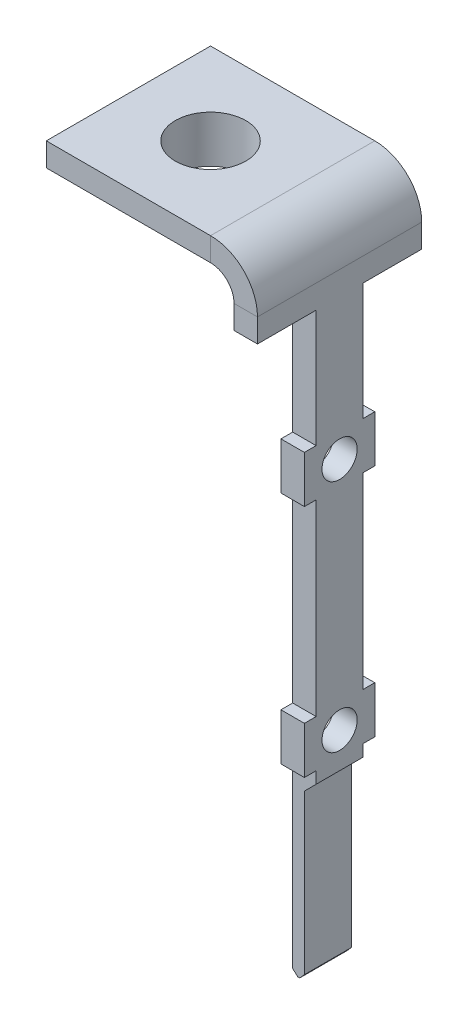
ISO-10303-21;
HEADER;
FILE_DESCRIPTION(('STEP AP214'),'2;1');
FILE_NAME('part.step','',(''),(''),'','','');
FILE_SCHEMA(('AUTOMOTIVE_DESIGN { 1 0 10303 214 1 1 1 1 }'));
ENDSEC;
DATA;
#1=APPLICATION_CONTEXT('core data for automotive mechanical design processes');
#2=APPLICATION_PROTOCOL_DEFINITION('international standard','automotive_design',2000,#1);
#3=PRODUCT_CONTEXT('',#1,'mechanical');
#4=PRODUCT('Part','Part','',(#3));
#5=PRODUCT_RELATED_PRODUCT_CATEGORY('part','',(#4));
#6=PRODUCT_DEFINITION_FORMATION('','',#4);
#7=PRODUCT_DEFINITION_CONTEXT('part definition',#1,'design');
#8=PRODUCT_DEFINITION('design','',#6,#7);
#9=PRODUCT_DEFINITION_SHAPE('','',#8);
#10=(LENGTH_UNIT() NAMED_UNIT(*) SI_UNIT(.MILLI.,.METRE.));
#11=(NAMED_UNIT(*) PLANE_ANGLE_UNIT() SI_UNIT($,.RADIAN.));
#12=(NAMED_UNIT(*) SI_UNIT($,.STERADIAN.) SOLID_ANGLE_UNIT());
#13=UNCERTAINTY_MEASURE_WITH_UNIT(LENGTH_MEASURE(1.E-05),#10,'distance_accuracy_value','');
#14=(GEOMETRIC_REPRESENTATION_CONTEXT(3) GLOBAL_UNCERTAINTY_ASSIGNED_CONTEXT((#13)) GLOBAL_UNIT_ASSIGNED_CONTEXT((#10,
#11,#12)) REPRESENTATION_CONTEXT('',''));
#15=CARTESIAN_POINT('',(0.,0.,0.));
#16=DIRECTION('',(0.,0.,1.));
#17=DIRECTION('',(1.,0.,0.));
#18=AXIS2_PLACEMENT_3D('',#15,#16,#17);
#19=CARTESIAN_POINT('',(-3.5,-1.,-3.5));
#20=DIRECTION('',(0.,-1.,0.));
#21=DIRECTION('',(0.,0.,-1.));
#22=AXIS2_PLACEMENT_3D('',#19,#20,#21);
#23=PLANE('',#22);
#24=CARTESIAN_POINT('',(0.,-1.,0.));
#25=DIRECTION('',(0.,-1.,0.));
#26=DIRECTION('',(0.,0.,-1.));
#27=AXIS2_PLACEMENT_3D('',#24,#25,#26);
#28=CIRCLE('',#27,2.5);
#29=CARTESIAN_POINT('',(0.,-1.,-2.5));
#30=VERTEX_POINT('',#29);
#31=EDGE_CURVE('E13',#30,#30,#28,.F.);
#32=ORIENTED_EDGE('',*,*,#31,.T.);
#33=EDGE_LOOP('',(#32));
#34=FACE_BOUND('',#33,.T.);
#35=DIRECTION('',(0.,0.,1.));
#36=VECTOR('',#35,1.);
#37=CARTESIAN_POINT('',(-3.5,-1.,3.5));
#38=LINE('',#37,#36);
#39=CARTESIAN_POINT('',(-3.5,-1.,-3.5));
#40=VERTEX_POINT('',#39);
#41=CARTESIAN_POINT('',(-3.5,-1.,3.5));
#42=VERTEX_POINT('',#41);
#43=EDGE_CURVE('E509',#40,#42,#38,.T.);
#44=ORIENTED_EDGE('',*,*,#43,.F.);
#45=DIRECTION('',(-1.,0.,0.));
#46=VECTOR('',#45,1.);
#47=CARTESIAN_POINT('',(-3.5,-1.,-3.5));
#48=LINE('',#47,#46);
#49=CARTESIAN_POINT('',(3.5,-1.,-3.5));
#50=VERTEX_POINT('',#49);
#51=EDGE_CURVE('E517',#50,#40,#48,.T.);
#52=ORIENTED_EDGE('',*,*,#51,.F.);
#53=DIRECTION('',(0.,0.,-1.));
#54=VECTOR('',#53,1.);
#55=CARTESIAN_POINT('',(3.5,-1.,3.5));
#56=LINE('',#55,#54);
#57=CARTESIAN_POINT('',(3.5,-1.,3.5));
#58=VERTEX_POINT('',#57);
#59=EDGE_CURVE('E515',#58,#50,#56,.T.);
#60=ORIENTED_EDGE('',*,*,#59,.F.);
#61=DIRECTION('',(1.,0.,0.));
#62=VECTOR('',#61,1.);
#63=CARTESIAN_POINT('',(-3.5,-1.,3.5));
#64=LINE('',#63,#62);
#65=EDGE_CURVE('E512',#42,#58,#64,.T.);
#66=ORIENTED_EDGE('',*,*,#65,.F.);
#67=EDGE_LOOP('',(#44,#52,#60,#66));
#68=FACE_BOUND('',#67,.T.);
#69=ADVANCED_FACE('F48',(#34,#68),#23,.T.);
#70=CARTESIAN_POINT('',(-3.5,-1.,3.5));
#71=DIRECTION('',(-1.,0.,0.));
#72=DIRECTION('',(0.,0.,1.));
#73=AXIS2_PLACEMENT_3D('',#70,#71,#72);
#74=PLANE('',#73);
#75=DIRECTION('',(0.,0.,1.));
#76=VECTOR('',#75,1.);
#77=CARTESIAN_POINT('',(-3.5,0.,3.5));
#78=LINE('',#77,#76);
#79=CARTESIAN_POINT('',(-3.5,0.,-3.5));
#80=VERTEX_POINT('',#79);
#81=CARTESIAN_POINT('',(-3.5,0.,3.5));
#82=VERTEX_POINT('',#81);
#83=EDGE_CURVE('E495',#80,#82,#78,.T.);
#84=ORIENTED_EDGE('',*,*,#83,.F.);
#85=DIRECTION('',(0.,1.,0.));
#86=VECTOR('',#85,1.);
#87=CARTESIAN_POINT('',(-3.5,-1.,-3.5));
#88=LINE('',#87,#86);
#89=EDGE_CURVE('E521',#40,#80,#88,.T.);
#90=ORIENTED_EDGE('',*,*,#89,.F.);
#91=ORIENTED_EDGE('',*,*,#43,.T.);
#92=DIRECTION('',(0.,1.,0.));
#93=VECTOR('',#92,1.);
#94=CARTESIAN_POINT('',(-3.5,-1.,3.5));
#95=LINE('',#94,#93);
#96=EDGE_CURVE('E520',#42,#82,#95,.T.);
#97=ORIENTED_EDGE('',*,*,#96,.T.);
#98=EDGE_LOOP('',(#84,#90,#91,#97));
#99=FACE_BOUND('',#98,.T.);
#100=ADVANCED_FACE('F50',(#99),#74,.T.);
#101=CARTESIAN_POINT('',(-3.5,-1.,-3.5));
#102=DIRECTION('',(0.,0.,-1.));
#103=DIRECTION('',(-1.,0.,0.));
#104=AXIS2_PLACEMENT_3D('',#101,#102,#103);
#105=PLANE('',#104);
#106=DIRECTION('',(-1.,0.,0.));
#107=VECTOR('',#106,1.);
#108=CARTESIAN_POINT('',(-3.5,0.,-3.5));
#109=LINE('',#108,#107);
#110=CARTESIAN_POINT('',(3.5,0.,-3.5));
#111=VERTEX_POINT('',#110);
#112=EDGE_CURVE('E506',#111,#80,#109,.T.);
#113=ORIENTED_EDGE('',*,*,#112,.F.);
#114=DIRECTION('',(0.,1.,0.));
#115=VECTOR('',#114,1.);
#116=CARTESIAN_POINT('',(3.5,-1.,-3.5));
#117=LINE('',#116,#115);
#118=EDGE_CURVE('E523',#50,#111,#117,.T.);
#119=ORIENTED_EDGE('',*,*,#118,.F.);
#120=ORIENTED_EDGE('',*,*,#51,.T.);
#121=ORIENTED_EDGE('',*,*,#89,.T.);
#122=EDGE_LOOP('',(#113,#119,#120,#121));
#123=FACE_BOUND('',#122,.T.);
#124=ADVANCED_FACE('F567',(#123),#105,.T.);
#125=CARTESIAN_POINT('',(-3.5,-1.,3.5));
#126=DIRECTION('',(0.,0.,1.));
#127=DIRECTION('',(1.,0.,0.));
#128=AXIS2_PLACEMENT_3D('',#125,#126,#127);
#129=PLANE('',#128);
#130=DIRECTION('',(1.,0.,0.));
#131=VECTOR('',#130,1.);
#132=CARTESIAN_POINT('',(-3.5,0.,3.5));
#133=LINE('',#132,#131);
#134=CARTESIAN_POINT('',(3.5,0.,3.5));
#135=VERTEX_POINT('',#134);
#136=EDGE_CURVE('E500',#82,#135,#133,.T.);
#137=ORIENTED_EDGE('',*,*,#136,.F.);
#138=ORIENTED_EDGE('',*,*,#96,.F.);
#139=ORIENTED_EDGE('',*,*,#65,.T.);
#140=DIRECTION('',(0.,1.,0.));
#141=VECTOR('',#140,1.);
#142=CARTESIAN_POINT('',(3.5,-1.,3.5));
#143=LINE('',#142,#141);
#144=EDGE_CURVE('E526',#58,#135,#143,.T.);
#145=ORIENTED_EDGE('',*,*,#144,.T.);
#146=EDGE_LOOP('',(#137,#138,#139,#145));
#147=FACE_BOUND('',#146,.T.);
#148=ADVANCED_FACE('F575',(#147),#129,.T.);
#149=CARTESIAN_POINT('',(-3.5,0.,-3.5));
#150=DIRECTION('',(0.,-1.,0.));
#151=DIRECTION('',(0.,0.,-1.));
#152=AXIS2_PLACEMENT_3D('',#149,#150,#151);
#153=PLANE('',#152);
#154=CARTESIAN_POINT('',(0.,0.,0.));
#155=DIRECTION('',(0.,1.,0.));
#156=DIRECTION('',(0.,0.,1.));
#157=AXIS2_PLACEMENT_3D('',#154,#155,#156);
#158=CIRCLE('',#157,1.5);
#159=CARTESIAN_POINT('',(0.,0.,1.5));
#160=VERTEX_POINT('',#159);
#161=EDGE_CURVE('E272',#160,#160,#158,.T.);
#162=ORIENTED_EDGE('',*,*,#161,.F.);
#163=EDGE_LOOP('',(#162));
#164=FACE_BOUND('',#163,.T.);
#165=ORIENTED_EDGE('',*,*,#83,.T.);
#166=ORIENTED_EDGE('',*,*,#136,.T.);
#167=DIRECTION('',(0.,0.,-1.));
#168=VECTOR('',#167,1.);
#169=CARTESIAN_POINT('',(3.5,0.,3.5));
#170=LINE('',#169,#168);
#171=EDGE_CURVE('E503',#135,#111,#170,.T.);
#172=ORIENTED_EDGE('',*,*,#171,.T.);
#173=ORIENTED_EDGE('',*,*,#112,.T.);
#174=EDGE_LOOP('',(#165,#166,#172,#173));
#175=FACE_BOUND('',#174,.T.);
#176=ADVANCED_FACE('F572',(#164,#175),#153,.F.);
#177=CARTESIAN_POINT('',(3.5,-2.,-3.5));
#178=DIRECTION('',(0.,0.,-1.));
#179=DIRECTION('',(-1.,0.,0.));
#180=AXIS2_PLACEMENT_3D('',#177,#178,#179);
#181=PLANE('',#180);
#182=DIRECTION('',(-1.,0.,0.));
#183=VECTOR('',#182,1.);
#184=CARTESIAN_POINT('',(5.5,-1.99999999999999,-3.5));
#185=LINE('',#184,#183);
#186=CARTESIAN_POINT('',(4.5,-2.,-3.5));
#187=VERTEX_POINT('',#186);
#188=CARTESIAN_POINT('',(5.5,-1.99999999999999,-3.5));
#189=VERTEX_POINT('',#188);
#190=EDGE_CURVE('E444',#187,#189,#185,.F.);
#191=ORIENTED_EDGE('',*,*,#190,.F.);
#192=CARTESIAN_POINT('',(3.5,-2.,-3.5));
#193=DIRECTION('',(0.,0.,1.));
#194=DIRECTION('',(1.,0.,0.));
#195=AXIS2_PLACEMENT_3D('',#192,#193,#194);
#196=CIRCLE('',#195,1.);
#197=EDGE_CURVE('E486',#50,#187,#196,.F.);
#198=ORIENTED_EDGE('',*,*,#197,.F.);
#199=ORIENTED_EDGE('',*,*,#118,.T.);
#200=CARTESIAN_POINT('',(3.5,-2.,-3.5));
#201=DIRECTION('',(0.,0.,1.));
#202=DIRECTION('',(1.,0.,0.));
#203=AXIS2_PLACEMENT_3D('',#200,#201,#202);
#204=CIRCLE('',#203,2.);
#205=EDGE_CURVE('E492',#111,#189,#204,.F.);
#206=ORIENTED_EDGE('',*,*,#205,.T.);
#207=EDGE_LOOP('',(#191,#198,#199,#206));
#208=FACE_BOUND('',#207,.T.);
#209=ADVANCED_FACE('F583',(#208),#181,.T.);
#210=CARTESIAN_POINT('',(3.5,-2.,3.5));
#211=DIRECTION('',(0.,0.,-1.));
#212=DIRECTION('',(-1.,0.,0.));
#213=AXIS2_PLACEMENT_3D('',#210,#211,#212);
#214=PLANE('',#213);
#215=CARTESIAN_POINT('',(3.5,-2.,3.5));
#216=DIRECTION('',(0.,0.,1.));
#217=DIRECTION('',(1.,0.,0.));
#218=AXIS2_PLACEMENT_3D('',#215,#216,#217);
#219=CIRCLE('',#218,1.);
#220=CARTESIAN_POINT('',(4.5,-2.,3.5));
#221=VERTEX_POINT('',#220);
#222=EDGE_CURVE('E467',#221,#58,#219,.T.);
#223=ORIENTED_EDGE('',*,*,#222,.F.);
#224=DIRECTION('',(-1.,0.,0.));
#225=VECTOR('',#224,1.);
#226=CARTESIAN_POINT('',(4.5,-2.,3.5));
#227=LINE('',#226,#225);
#228=CARTESIAN_POINT('',(5.5,-1.99999999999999,3.5));
#229=VERTEX_POINT('',#228);
#230=EDGE_CURVE('E479',#221,#229,#227,.F.);
#231=ORIENTED_EDGE('',*,*,#230,.T.);
#232=CARTESIAN_POINT('',(3.5,-2.,3.5));
#233=DIRECTION('',(0.,0.,1.));
#234=DIRECTION('',(1.,0.,0.));
#235=AXIS2_PLACEMENT_3D('',#232,#233,#234);
#236=CIRCLE('',#235,2.);
#237=EDGE_CURVE('E489',#229,#135,#236,.T.);
#238=ORIENTED_EDGE('',*,*,#237,.T.);
#239=ORIENTED_EDGE('',*,*,#144,.F.);
#240=EDGE_LOOP('',(#223,#231,#238,#239));
#241=FACE_BOUND('',#240,.T.);
#242=ADVANCED_FACE('F601',(#241),#214,.F.);
#243=CARTESIAN_POINT('',(3.5,-2.,3.5));
#244=DIRECTION('',(0.,0.,1.));
#245=DIRECTION('',(1.,0.,0.));
#246=AXIS2_PLACEMENT_3D('',#243,#244,#245);
#247=CYLINDRICAL_SURFACE('',#246,2.);
#248=ORIENTED_EDGE('',*,*,#171,.F.);
#249=ORIENTED_EDGE('',*,*,#237,.F.);
#250=DIRECTION('',(0.,0.,1.));
#251=VECTOR('',#250,1.);
#252=CARTESIAN_POINT('',(5.5,-1.99999999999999,-3.5));
#253=LINE('',#252,#251);
#254=EDGE_CURVE('E476',#229,#189,#253,.F.);
#255=ORIENTED_EDGE('',*,*,#254,.T.);
#256=ORIENTED_EDGE('',*,*,#205,.F.);
#257=EDGE_LOOP('',(#248,#249,#255,#256));
#258=FACE_BOUND('',#257,.T.);
#259=ADVANCED_FACE('F598',(#258),#247,.T.);
#260=CARTESIAN_POINT('',(3.5,-2.,3.5));
#261=DIRECTION('',(0.,0.,1.));
#262=DIRECTION('',(1.,0.,0.));
#263=AXIS2_PLACEMENT_3D('',#260,#261,#262);
#264=CYLINDRICAL_SURFACE('',#263,1.);
#265=ORIENTED_EDGE('',*,*,#59,.T.);
#266=ORIENTED_EDGE('',*,*,#197,.T.);
#267=DIRECTION('',(0.,0.,1.));
#268=VECTOR('',#267,1.);
#269=CARTESIAN_POINT('',(4.5,-2.,-3.5));
#270=LINE('',#269,#268);
#271=EDGE_CURVE('E482',#187,#221,#270,.T.);
#272=ORIENTED_EDGE('',*,*,#271,.T.);
#273=ORIENTED_EDGE('',*,*,#222,.T.);
#274=EDGE_LOOP('',(#265,#266,#272,#273));
#275=FACE_BOUND('',#274,.T.);
#276=ADVANCED_FACE('F704',(#275),#264,.F.);
#277=CARTESIAN_POINT('',(5.50000000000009,-28.,3.5));
#278=DIRECTION('',(0.,0.,-1.));
#279=DIRECTION('',(-1.,0.,0.));
#280=AXIS2_PLACEMENT_3D('',#277,#278,#279);
#281=PLANE('',#280);
#282=DIRECTION('',(0.,1.,0.));
#283=VECTOR('',#282,1.);
#284=CARTESIAN_POINT('',(4.50000000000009,-28.,3.5));
#285=LINE('',#284,#283);
#286=CARTESIAN_POINT('',(4.5,-3.,3.5));
#287=VERTEX_POINT('',#286);
#288=EDGE_CURVE('E473',#221,#287,#285,.F.);
#289=ORIENTED_EDGE('',*,*,#288,.T.);
#290=DIRECTION('',(1.,0.,0.));
#291=VECTOR('',#290,1.);
#292=CARTESIAN_POINT('',(4.5,-3.,3.5));
#293=LINE('',#292,#291);
#294=CARTESIAN_POINT('',(5.5,-3.,3.5));
#295=VERTEX_POINT('',#294);
#296=EDGE_CURVE('E441',#287,#295,#293,.T.);
#297=ORIENTED_EDGE('',*,*,#296,.T.);
#298=DIRECTION('',(0.,-1.,0.));
#299=VECTOR('',#298,1.);
#300=CARTESIAN_POINT('',(5.5,-0.999999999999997,3.5));
#301=LINE('',#300,#299);
#302=EDGE_CURVE('E468',#229,#295,#301,.T.);
#303=ORIENTED_EDGE('',*,*,#302,.F.);
#304=ORIENTED_EDGE('',*,*,#230,.F.);
#305=EDGE_LOOP('',(#289,#297,#303,#304));
#306=FACE_BOUND('',#305,.T.);
#307=ADVANCED_FACE('F613',(#306),#281,.F.);
#308=CARTESIAN_POINT('',(5.5,-0.999999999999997,-3.5));
#309=DIRECTION('',(0.,0.,1.));
#310=DIRECTION('',(1.,0.,0.));
#311=AXIS2_PLACEMENT_3D('',#308,#309,#310);
#312=PLANE('',#311);
#313=DIRECTION('',(0.,1.,0.));
#314=VECTOR('',#313,1.);
#315=CARTESIAN_POINT('',(5.5,-0.999999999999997,-3.5));
#316=LINE('',#315,#314);
#317=CARTESIAN_POINT('',(5.5,-3.,-3.5));
#318=VERTEX_POINT('',#317);
#319=EDGE_CURVE('E465',#318,#189,#316,.T.);
#320=ORIENTED_EDGE('',*,*,#319,.F.);
#321=DIRECTION('',(1.,0.,0.));
#322=VECTOR('',#321,1.);
#323=CARTESIAN_POINT('',(4.5,-3.,-3.5));
#324=LINE('',#323,#322);
#325=CARTESIAN_POINT('',(4.5,-3.,-3.5));
#326=VERTEX_POINT('',#325);
#327=EDGE_CURVE('E355',#326,#318,#324,.T.);
#328=ORIENTED_EDGE('',*,*,#327,.F.);
#329=DIRECTION('',(0.,-1.,0.));
#330=VECTOR('',#329,1.);
#331=CARTESIAN_POINT('',(4.5,-1.,-3.5));
#332=LINE('',#331,#330);
#333=EDGE_CURVE('E471',#326,#187,#332,.F.);
#334=ORIENTED_EDGE('',*,*,#333,.T.);
#335=ORIENTED_EDGE('',*,*,#190,.T.);
#336=EDGE_LOOP('',(#320,#328,#334,#335));
#337=FACE_BOUND('',#336,.T.);
#338=ADVANCED_FACE('F702',(#337),#312,.F.);
#339=CARTESIAN_POINT('',(5.5,-0.999999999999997,3.5));
#340=DIRECTION('',(-1.,0.,0.));
#341=DIRECTION('',(0.,-1.,0.));
#342=AXIS2_PLACEMENT_3D('',#339,#340,#341);
#343=PLANE('',#342);
#344=CARTESIAN_POINT('',(5.50000000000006,-19.,0.));
#345=DIRECTION('',(1.,0.,0.));
#346=DIRECTION('',(0.,1.,0.));
#347=AXIS2_PLACEMENT_3D('',#344,#345,#346);
#348=CIRCLE('',#347,0.75);
#349=CARTESIAN_POINT('',(5.50000000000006,-18.25,0.));
#350=VERTEX_POINT('',#349);
#351=EDGE_CURVE('E352',#350,#350,#348,.T.);
#352=ORIENTED_EDGE('',*,*,#351,.F.);
#353=EDGE_LOOP('',(#352));
#354=FACE_BOUND('',#353,.T.);
#355=CARTESIAN_POINT('',(5.50000000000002,-9.,0.));
#356=DIRECTION('',(1.,0.,0.));
#357=DIRECTION('',(0.,1.,0.));
#358=AXIS2_PLACEMENT_3D('',#355,#356,#357);
#359=CIRCLE('',#358,0.75);
#360=CARTESIAN_POINT('',(5.50000000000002,-8.25,0.));
#361=VERTEX_POINT('',#360);
#362=EDGE_CURVE('E377',#361,#361,#359,.T.);
#363=ORIENTED_EDGE('',*,*,#362,.F.);
#364=EDGE_LOOP('',(#363));
#365=FACE_BOUND('',#364,.T.);
#366=DIRECTION('',(0.,1.,0.));
#367=VECTOR('',#366,1.);
#368=CARTESIAN_POINT('',(5.50000000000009,-28.,0.999999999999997));
#369=LINE('',#368,#367);
#370=CARTESIAN_POINT('',(5.50000000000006,-20.5,1.));
#371=VERTEX_POINT('',#370);
#372=CARTESIAN_POINT('',(5.50000000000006,-20.,0.999999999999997));
#373=VERTEX_POINT('',#372);
#374=EDGE_CURVE('E383',#371,#373,#369,.T.);
#375=ORIENTED_EDGE('',*,*,#374,.F.);
#376=DIRECTION('',(0.,0.,-1.));
#377=VECTOR('',#376,1.);
#378=CARTESIAN_POINT('',(5.50000000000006,-20.5,1.));
#379=LINE('',#378,#377);
#380=CARTESIAN_POINT('',(5.50000000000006,-20.5,-0.999999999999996));
#381=VERTEX_POINT('',#380);
#382=EDGE_CURVE('E279',#371,#381,#379,.T.);
#383=ORIENTED_EDGE('',*,*,#382,.T.);
#384=DIRECTION('',(0.,-1.,0.));
#385=VECTOR('',#384,1.);
#386=CARTESIAN_POINT('',(5.50000000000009,-28.,-1.));
#387=LINE('',#386,#385);
#388=CARTESIAN_POINT('',(5.50000000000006,-20.,-1.));
#389=VERTEX_POINT('',#388);
#390=EDGE_CURVE('E284',#389,#381,#387,.T.);
#391=ORIENTED_EDGE('',*,*,#390,.F.);
#392=DIRECTION('',(0.,0.,1.));
#393=VECTOR('',#392,1.);
#394=CARTESIAN_POINT('',(5.50000000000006,-20.,-1.));
#395=LINE('',#394,#393);
#396=CARTESIAN_POINT('',(5.50000000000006,-20.,-1.5));
#397=VERTEX_POINT('',#396);
#398=EDGE_CURVE('E310',#397,#389,#395,.T.);
#399=ORIENTED_EDGE('',*,*,#398,.F.);
#400=DIRECTION('',(0.,-1.,0.));
#401=VECTOR('',#400,1.);
#402=CARTESIAN_POINT('',(5.50000000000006,-18.,-1.5));
#403=LINE('',#402,#401);
#404=CARTESIAN_POINT('',(5.50000000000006,-18.,-1.5));
#405=VERTEX_POINT('',#404);
#406=EDGE_CURVE('E307',#405,#397,#403,.T.);
#407=ORIENTED_EDGE('',*,*,#406,.F.);
#408=DIRECTION('',(0.,0.,-1.));
#409=VECTOR('',#408,1.);
#410=CARTESIAN_POINT('',(5.50000000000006,-18.,-1.));
#411=LINE('',#410,#409);
#412=CARTESIAN_POINT('',(5.50000000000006,-18.,-1.));
#413=VERTEX_POINT('',#412);
#414=EDGE_CURVE('E304',#413,#405,#411,.T.);
#415=ORIENTED_EDGE('',*,*,#414,.F.);
#416=DIRECTION('',(0.,-1.,0.));
#417=VECTOR('',#416,1.);
#418=CARTESIAN_POINT('',(5.50000000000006,-18.,-1.));
#419=LINE('',#418,#417);
#420=CARTESIAN_POINT('',(5.50000000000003,-10.,-0.999999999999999));
#421=VERTEX_POINT('',#420);
#422=EDGE_CURVE('E301',#421,#413,#419,.T.);
#423=ORIENTED_EDGE('',*,*,#422,.F.);
#424=DIRECTION('',(0.,0.,1.));
#425=VECTOR('',#424,1.);
#426=CARTESIAN_POINT('',(5.50000000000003,-10.,-0.999999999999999));
#427=LINE('',#426,#425);
#428=CARTESIAN_POINT('',(5.50000000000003,-10.,-1.5));
#429=VERTEX_POINT('',#428);
#430=EDGE_CURVE('E298',#429,#421,#427,.T.);
#431=ORIENTED_EDGE('',*,*,#430,.F.);
#432=DIRECTION('',(0.,-1.,0.));
#433=VECTOR('',#432,1.);
#434=CARTESIAN_POINT('',(5.50000000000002,-8.,-1.5));
#435=LINE('',#434,#433);
#436=CARTESIAN_POINT('',(5.50000000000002,-8.,-1.5));
#437=VERTEX_POINT('',#436);
#438=EDGE_CURVE('E295',#437,#429,#435,.T.);
#439=ORIENTED_EDGE('',*,*,#438,.F.);
#440=DIRECTION('',(0.,0.,-1.));
#441=VECTOR('',#440,1.);
#442=CARTESIAN_POINT('',(5.50000000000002,-8.,-0.999999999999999));
#443=LINE('',#442,#441);
#444=CARTESIAN_POINT('',(5.50000000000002,-8.,-0.999999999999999));
#445=VERTEX_POINT('',#444);
#446=EDGE_CURVE('E291',#445,#437,#443,.T.);
#447=ORIENTED_EDGE('',*,*,#446,.F.);
#448=DIRECTION('',(0.,-1.,0.));
#449=VECTOR('',#448,1.);
#450=CARTESIAN_POINT('',(5.50000000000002,-8.,-0.999999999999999));
#451=LINE('',#450,#449);
#452=CARTESIAN_POINT('',(5.5,-3.,-0.999999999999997));
#453=VERTEX_POINT('',#452);
#454=EDGE_CURVE('E317',#453,#445,#451,.T.);
#455=ORIENTED_EDGE('',*,*,#454,.F.);
#456=DIRECTION('',(0.,0.,1.));
#457=VECTOR('',#456,1.);
#458=CARTESIAN_POINT('',(5.5,-3.,-3.5));
#459=LINE('',#458,#457);
#460=EDGE_CURVE('E314',#318,#453,#459,.T.);
#461=ORIENTED_EDGE('',*,*,#460,.F.);
#462=ORIENTED_EDGE('',*,*,#319,.T.);
#463=ORIENTED_EDGE('',*,*,#254,.F.);
#464=ORIENTED_EDGE('',*,*,#302,.T.);
#465=DIRECTION('',(0.,0.,1.));
#466=VECTOR('',#465,1.);
#467=CARTESIAN_POINT('',(5.5,-3.,3.5));
#468=LINE('',#467,#466);
#469=CARTESIAN_POINT('',(5.5,-3.,0.999999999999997));
#470=VERTEX_POINT('',#469);
#471=EDGE_CURVE('E409',#470,#295,#468,.T.);
#472=ORIENTED_EDGE('',*,*,#471,.F.);
#473=DIRECTION('',(0.,1.,0.));
#474=VECTOR('',#473,1.);
#475=CARTESIAN_POINT('',(5.50000000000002,-8.,0.999999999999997));
#476=LINE('',#475,#474);
#477=CARTESIAN_POINT('',(5.50000000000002,-8.,0.999999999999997));
#478=VERTEX_POINT('',#477);
#479=EDGE_CURVE('E406',#478,#470,#476,.T.);
#480=ORIENTED_EDGE('',*,*,#479,.F.);
#481=DIRECTION('',(0.,0.,-1.));
#482=VECTOR('',#481,1.);
#483=CARTESIAN_POINT('',(5.50000000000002,-8.,0.999999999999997));
#484=LINE('',#483,#482);
#485=CARTESIAN_POINT('',(5.50000000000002,-8.,1.5));
#486=VERTEX_POINT('',#485);
#487=EDGE_CURVE('E403',#486,#478,#484,.T.);
#488=ORIENTED_EDGE('',*,*,#487,.F.);
#489=DIRECTION('',(0.,1.,0.));
#490=VECTOR('',#489,1.);
#491=CARTESIAN_POINT('',(5.50000000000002,-8.,1.5));
#492=LINE('',#491,#490);
#493=CARTESIAN_POINT('',(5.50000000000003,-10.,1.5));
#494=VERTEX_POINT('',#493);
#495=EDGE_CURVE('E400',#494,#486,#492,.T.);
#496=ORIENTED_EDGE('',*,*,#495,.F.);
#497=DIRECTION('',(0.,0.,1.));
#498=VECTOR('',#497,1.);
#499=CARTESIAN_POINT('',(5.50000000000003,-10.,0.999999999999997));
#500=LINE('',#499,#498);
#501=CARTESIAN_POINT('',(5.50000000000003,-10.,0.999999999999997));
#502=VERTEX_POINT('',#501);
#503=EDGE_CURVE('E397',#502,#494,#500,.T.);
#504=ORIENTED_EDGE('',*,*,#503,.F.);
#505=DIRECTION('',(0.,1.,0.));
#506=VECTOR('',#505,1.);
#507=CARTESIAN_POINT('',(5.50000000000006,-18.,0.999999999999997));
#508=LINE('',#507,#506);
#509=CARTESIAN_POINT('',(5.50000000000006,-18.,0.999999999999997));
#510=VERTEX_POINT('',#509);
#511=EDGE_CURVE('E394',#510,#502,#508,.T.);
#512=ORIENTED_EDGE('',*,*,#511,.F.);
#513=DIRECTION('',(0.,0.,-1.));
#514=VECTOR('',#513,1.);
#515=CARTESIAN_POINT('',(5.50000000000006,-18.,0.999999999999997));
#516=LINE('',#515,#514);
#517=CARTESIAN_POINT('',(5.50000000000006,-18.,1.5));
#518=VERTEX_POINT('',#517);
#519=EDGE_CURVE('E391',#518,#510,#516,.T.);
#520=ORIENTED_EDGE('',*,*,#519,.F.);
#521=DIRECTION('',(0.,1.,0.));
#522=VECTOR('',#521,1.);
#523=CARTESIAN_POINT('',(5.50000000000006,-18.,1.5));
#524=LINE('',#523,#522);
#525=CARTESIAN_POINT('',(5.50000000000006,-20.,1.5));
#526=VERTEX_POINT('',#525);
#527=EDGE_CURVE('E388',#526,#518,#524,.T.);
#528=ORIENTED_EDGE('',*,*,#527,.F.);
#529=DIRECTION('',(0.,0.,1.));
#530=VECTOR('',#529,1.);
#531=CARTESIAN_POINT('',(5.50000000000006,-20.,0.999999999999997));
#532=LINE('',#531,#530);
#533=EDGE_CURVE('E385',#373,#526,#532,.T.);
#534=ORIENTED_EDGE('',*,*,#533,.F.);
#535=EDGE_LOOP('',(#375,#383,#391,#399,#407,#415,#423,#431,#439,#447,#455,#461,#462,#463,#464,
#472,#480,#488,#496,#504,#512,#520,#528,#534));
#536=FACE_BOUND('',#535,.T.);
#537=ADVANCED_FACE('F609',(#354,#365,#536),#343,.F.);
#538=CARTESIAN_POINT('',(4.5,-1.,3.5));
#539=DIRECTION('',(-1.,0.,0.));
#540=DIRECTION('',(0.,-1.,0.));
#541=AXIS2_PLACEMENT_3D('',#538,#539,#540);
#542=PLANE('',#541);
#543=DIRECTION('',(0.,-1.,0.));
#544=VECTOR('',#543,1.);
#545=CARTESIAN_POINT('',(4.50000000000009,-28.,-1.));
#546=LINE('',#545,#544);
#547=CARTESIAN_POINT('',(4.50000000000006,-20.,-1.));
#548=VERTEX_POINT('',#547);
#549=CARTESIAN_POINT('',(4.50000000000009,-27.8,-1.));
#550=VERTEX_POINT('',#549);
#551=EDGE_CURVE('E341',#548,#550,#546,.T.);
#552=ORIENTED_EDGE('',*,*,#551,.T.);
#553=DIRECTION('',(0.,0.,1.));
#554=VECTOR('',#553,1.);
#555=CARTESIAN_POINT('',(4.50000000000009,-27.8,0.999999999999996));
#556=LINE('',#555,#554);
#557=CARTESIAN_POINT('',(4.50000000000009,-27.8,0.999999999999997));
#558=VERTEX_POINT('',#557);
#559=EDGE_CURVE('E63',#550,#558,#556,.T.);
#560=ORIENTED_EDGE('',*,*,#559,.T.);
#561=DIRECTION('',(0.,1.,0.));
#562=VECTOR('',#561,1.);
#563=CARTESIAN_POINT('',(4.50000000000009,-28.,0.999999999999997));
#564=LINE('',#563,#562);
#565=CARTESIAN_POINT('',(4.50000000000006,-20.,0.999999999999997));
#566=VERTEX_POINT('',#565);
#567=EDGE_CURVE('E411',#558,#566,#564,.T.);
#568=ORIENTED_EDGE('',*,*,#567,.T.);
#569=DIRECTION('',(0.,0.,1.));
#570=VECTOR('',#569,1.);
#571=CARTESIAN_POINT('',(4.50000000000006,-20.,0.999999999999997));
#572=LINE('',#571,#570);
#573=CARTESIAN_POINT('',(4.50000000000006,-20.,1.5));
#574=VERTEX_POINT('',#573);
#575=EDGE_CURVE('E413',#566,#574,#572,.T.);
#576=ORIENTED_EDGE('',*,*,#575,.T.);
#577=DIRECTION('',(0.,1.,0.));
#578=VECTOR('',#577,1.);
#579=CARTESIAN_POINT('',(4.50000000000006,-18.,1.5));
#580=LINE('',#579,#578);
#581=CARTESIAN_POINT('',(4.50000000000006,-18.,1.5));
#582=VERTEX_POINT('',#581);
#583=EDGE_CURVE('E416',#574,#582,#580,.T.);
#584=ORIENTED_EDGE('',*,*,#583,.T.);
#585=DIRECTION('',(0.,0.,-1.));
#586=VECTOR('',#585,1.);
#587=CARTESIAN_POINT('',(4.50000000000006,-18.,0.999999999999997));
#588=LINE('',#587,#586);
#589=CARTESIAN_POINT('',(4.50000000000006,-18.,0.999999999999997));
#590=VERTEX_POINT('',#589);
#591=EDGE_CURVE('E419',#582,#590,#588,.T.);
#592=ORIENTED_EDGE('',*,*,#591,.T.);
#593=DIRECTION('',(0.,1.,0.));
#594=VECTOR('',#593,1.);
#595=CARTESIAN_POINT('',(4.50000000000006,-18.,0.999999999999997));
#596=LINE('',#595,#594);
#597=CARTESIAN_POINT('',(4.50000000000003,-10.,0.999999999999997));
#598=VERTEX_POINT('',#597);
#599=EDGE_CURVE('E422',#590,#598,#596,.T.);
#600=ORIENTED_EDGE('',*,*,#599,.T.);
#601=DIRECTION('',(0.,0.,1.));
#602=VECTOR('',#601,1.);
#603=CARTESIAN_POINT('',(4.50000000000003,-10.,0.999999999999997));
#604=LINE('',#603,#602);
#605=CARTESIAN_POINT('',(4.50000000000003,-10.,1.5));
#606=VERTEX_POINT('',#605);
#607=EDGE_CURVE('E425',#598,#606,#604,.T.);
#608=ORIENTED_EDGE('',*,*,#607,.T.);
#609=DIRECTION('',(0.,1.,0.));
#610=VECTOR('',#609,1.);
#611=CARTESIAN_POINT('',(4.50000000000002,-8.,1.5));
#612=LINE('',#611,#610);
#613=CARTESIAN_POINT('',(4.50000000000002,-8.,1.5));
#614=VERTEX_POINT('',#613);
#615=EDGE_CURVE('E428',#606,#614,#612,.T.);
#616=ORIENTED_EDGE('',*,*,#615,.T.);
#617=DIRECTION('',(0.,0.,-1.));
#618=VECTOR('',#617,1.);
#619=CARTESIAN_POINT('',(4.50000000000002,-8.,0.999999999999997));
#620=LINE('',#619,#618);
#621=CARTESIAN_POINT('',(4.50000000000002,-8.,0.999999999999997));
#622=VERTEX_POINT('',#621);
#623=EDGE_CURVE('E431',#614,#622,#620,.T.);
#624=ORIENTED_EDGE('',*,*,#623,.T.);
#625=DIRECTION('',(0.,1.,0.));
#626=VECTOR('',#625,1.);
#627=CARTESIAN_POINT('',(4.50000000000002,-8.,0.999999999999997));
#628=LINE('',#627,#626);
#629=CARTESIAN_POINT('',(4.5,-3.,0.999999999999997));
#630=VERTEX_POINT('',#629);
#631=EDGE_CURVE('E434',#622,#630,#628,.T.);
#632=ORIENTED_EDGE('',*,*,#631,.T.);
#633=DIRECTION('',(0.,0.,1.));
#634=VECTOR('',#633,1.);
#635=CARTESIAN_POINT('',(4.5,-3.,3.5));
#636=LINE('',#635,#634);
#637=EDGE_CURVE('E437',#630,#287,#636,.T.);
#638=ORIENTED_EDGE('',*,*,#637,.T.);
#639=ORIENTED_EDGE('',*,*,#288,.F.);
#640=ORIENTED_EDGE('',*,*,#271,.F.);
#641=ORIENTED_EDGE('',*,*,#333,.F.);
#642=DIRECTION('',(0.,0.,1.));
#643=VECTOR('',#642,1.);
#644=CARTESIAN_POINT('',(4.5,-3.,-3.5));
#645=LINE('',#644,#643);
#646=CARTESIAN_POINT('',(4.5,-3.,-0.999999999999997));
#647=VERTEX_POINT('',#646);
#648=EDGE_CURVE('E343',#326,#647,#645,.T.);
#649=ORIENTED_EDGE('',*,*,#648,.T.);
#650=DIRECTION('',(0.,-1.,0.));
#651=VECTOR('',#650,1.);
#652=CARTESIAN_POINT('',(4.50000000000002,-8.,-0.999999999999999));
#653=LINE('',#652,#651);
#654=CARTESIAN_POINT('',(4.50000000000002,-8.,-0.999999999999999));
#655=VERTEX_POINT('',#654);
#656=EDGE_CURVE('E346',#647,#655,#653,.T.);
#657=ORIENTED_EDGE('',*,*,#656,.T.);
#658=DIRECTION('',(0.,0.,-1.));
#659=VECTOR('',#658,1.);
#660=CARTESIAN_POINT('',(4.50000000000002,-8.,-0.999999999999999));
#661=LINE('',#660,#659);
#662=CARTESIAN_POINT('',(4.50000000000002,-8.,-1.5));
#663=VERTEX_POINT('',#662);
#664=EDGE_CURVE('E320',#655,#663,#661,.T.);
#665=ORIENTED_EDGE('',*,*,#664,.T.);
#666=DIRECTION('',(0.,-1.,0.));
#667=VECTOR('',#666,1.);
#668=CARTESIAN_POINT('',(4.50000000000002,-8.,-1.5));
#669=LINE('',#668,#667);
#670=CARTESIAN_POINT('',(4.50000000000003,-10.,-1.5));
#671=VERTEX_POINT('',#670);
#672=EDGE_CURVE('E323',#663,#671,#669,.T.);
#673=ORIENTED_EDGE('',*,*,#672,.T.);
#674=DIRECTION('',(0.,0.,1.));
#675=VECTOR('',#674,1.);
#676=CARTESIAN_POINT('',(4.50000000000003,-10.,-0.999999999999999));
#677=LINE('',#676,#675);
#678=CARTESIAN_POINT('',(4.50000000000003,-10.,-0.999999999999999));
#679=VERTEX_POINT('',#678);
#680=EDGE_CURVE('E326',#671,#679,#677,.T.);
#681=ORIENTED_EDGE('',*,*,#680,.T.);
#682=DIRECTION('',(0.,-1.,0.));
#683=VECTOR('',#682,1.);
#684=CARTESIAN_POINT('',(4.50000000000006,-18.,-1.));
#685=LINE('',#684,#683);
#686=CARTESIAN_POINT('',(4.50000000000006,-18.,-1.));
#687=VERTEX_POINT('',#686);
#688=EDGE_CURVE('E329',#679,#687,#685,.T.);
#689=ORIENTED_EDGE('',*,*,#688,.T.);
#690=DIRECTION('',(0.,0.,-1.));
#691=VECTOR('',#690,1.);
#692=CARTESIAN_POINT('',(4.50000000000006,-18.,-1.));
#693=LINE('',#692,#691);
#694=CARTESIAN_POINT('',(4.50000000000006,-18.,-1.5));
#695=VERTEX_POINT('',#694);
#696=EDGE_CURVE('E332',#687,#695,#693,.T.);
#697=ORIENTED_EDGE('',*,*,#696,.T.);
#698=DIRECTION('',(0.,-1.,0.));
#699=VECTOR('',#698,1.);
#700=CARTESIAN_POINT('',(4.50000000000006,-18.,-1.5));
#701=LINE('',#700,#699);
#702=CARTESIAN_POINT('',(4.50000000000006,-20.,-1.5));
#703=VERTEX_POINT('',#702);
#704=EDGE_CURVE('E335',#695,#703,#701,.T.);
#705=ORIENTED_EDGE('',*,*,#704,.T.);
#706=DIRECTION('',(0.,0.,1.));
#707=VECTOR('',#706,1.);
#708=CARTESIAN_POINT('',(4.50000000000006,-20.,-1.));
#709=LINE('',#708,#707);
#710=EDGE_CURVE('E338',#703,#548,#709,.T.);
#711=ORIENTED_EDGE('',*,*,#710,.T.);
#712=EDGE_LOOP('',(#552,#560,#568,#576,#584,#592,#600,#608,#616,#624,#632,#638,#639,#640,#641,
#649,#657,#665,#673,#681,#689,#697,#705,#711));
#713=FACE_BOUND('',#712,.T.);
#714=CARTESIAN_POINT('',(4.50000000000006,-19.,0.));
#715=DIRECTION('',(1.,0.,0.));
#716=DIRECTION('',(0.,1.,0.));
#717=AXIS2_PLACEMENT_3D('',#714,#715,#716);
#718=CIRCLE('',#717,0.75);
#719=CARTESIAN_POINT('',(4.50000000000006,-18.25,0.));
#720=VERTEX_POINT('',#719);
#721=EDGE_CURVE('E374',#720,#720,#718,.T.);
#722=ORIENTED_EDGE('',*,*,#721,.T.);
#723=EDGE_LOOP('',(#722));
#724=FACE_BOUND('',#723,.T.);
#725=CARTESIAN_POINT('',(4.50000000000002,-9.,0.));
#726=DIRECTION('',(1.,0.,0.));
#727=DIRECTION('',(0.,1.,0.));
#728=AXIS2_PLACEMENT_3D('',#725,#726,#727);
#729=CIRCLE('',#728,0.75);
#730=CARTESIAN_POINT('',(4.50000000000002,-8.25,0.));
#731=VERTEX_POINT('',#730);
#732=EDGE_CURVE('E380',#731,#731,#729,.T.);
#733=ORIENTED_EDGE('',*,*,#732,.T.);
#734=EDGE_LOOP('',(#733));
#735=FACE_BOUND('',#734,.T.);
#736=ADVANCED_FACE('F617',(#713,#724,#735),#542,.T.);
#737=CARTESIAN_POINT('',(5.50000000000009,-28.,-3.5));
#738=DIRECTION('',(0.,1.,0.));
#739=DIRECTION('',(-1.,0.,0.));
#740=AXIS2_PLACEMENT_3D('',#737,#738,#739);
#741=PLANE('',#740);
#742=DIRECTION('',(1.,0.,0.));
#743=VECTOR('',#742,1.);
#744=CARTESIAN_POINT('',(4.50000000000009,-28.,-1.));
#745=LINE('',#744,#743);
#746=CARTESIAN_POINT('',(4.72212250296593,-28.,-1.));
#747=VERTEX_POINT('',#746);
#748=CARTESIAN_POINT('',(4.80000000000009,-28.,-1.));
#749=VERTEX_POINT('',#748);
#750=EDGE_CURVE('E357',#747,#749,#745,.T.);
#751=ORIENTED_EDGE('',*,*,#750,.T.);
#752=DIRECTION('',(0.,0.,1.));
#753=VECTOR('',#752,1.);
#754=CARTESIAN_POINT('',(4.80000000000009,-28.,-3.5));
#755=LINE('',#754,#753);
#756=CARTESIAN_POINT('',(4.80000000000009,-28.,0.999999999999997));
#757=VERTEX_POINT('',#756);
#758=EDGE_CURVE('E71',#749,#757,#755,.T.);
#759=ORIENTED_EDGE('',*,*,#758,.T.);
#760=DIRECTION('',(1.,0.,0.));
#761=VECTOR('',#760,1.);
#762=CARTESIAN_POINT('',(4.50000000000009,-28.,0.999999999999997));
#763=LINE('',#762,#761);
#764=CARTESIAN_POINT('',(4.72212250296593,-28.,0.999999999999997));
#765=VERTEX_POINT('',#764);
#766=EDGE_CURVE('E440',#765,#757,#763,.T.);
#767=ORIENTED_EDGE('',*,*,#766,.F.);
#768=DIRECTION('',(0.,0.,-1.));
#769=VECTOR('',#768,1.);
#770=CARTESIAN_POINT('',(4.72212250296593,-28.,-1.));
#771=LINE('',#770,#769);
#772=EDGE_CURVE('E535',#765,#747,#771,.T.);
#773=ORIENTED_EDGE('',*,*,#772,.T.);
#774=EDGE_LOOP('',(#751,#759,#767,#773));
#775=FACE_BOUND('',#774,.T.);
#776=ADVANCED_FACE('F660',(#775),#741,.F.);
#777=CARTESIAN_POINT('',(4.5,-3.,3.5));
#778=DIRECTION('',(0.,1.,0.));
#779=DIRECTION('',(-1.,0.,0.));
#780=AXIS2_PLACEMENT_3D('',#777,#778,#779);
#781=PLANE('',#780);
#782=ORIENTED_EDGE('',*,*,#471,.T.);
#783=ORIENTED_EDGE('',*,*,#296,.F.);
#784=ORIENTED_EDGE('',*,*,#637,.F.);
#785=DIRECTION('',(1.,0.,0.));
#786=VECTOR('',#785,1.);
#787=CARTESIAN_POINT('',(4.5,-3.,0.999999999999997));
#788=LINE('',#787,#786);
#789=EDGE_CURVE('E445',#630,#470,#788,.T.);
#790=ORIENTED_EDGE('',*,*,#789,.T.);
#791=EDGE_LOOP('',(#782,#783,#784,#790));
#792=FACE_BOUND('',#791,.T.);
#793=ADVANCED_FACE('F616',(#792),#781,.F.);
#794=CARTESIAN_POINT('',(4.50000000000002,-8.,0.999999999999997));
#795=DIRECTION('',(0.,0.,-1.));
#796=DIRECTION('',(-1.,0.,0.));
#797=AXIS2_PLACEMENT_3D('',#794,#795,#796);
#798=PLANE('',#797);
#799=ORIENTED_EDGE('',*,*,#479,.T.);
#800=ORIENTED_EDGE('',*,*,#789,.F.);
#801=ORIENTED_EDGE('',*,*,#631,.F.);
#802=DIRECTION('',(1.,0.,0.));
#803=VECTOR('',#802,1.);
#804=CARTESIAN_POINT('',(4.50000000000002,-8.,0.999999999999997));
#805=LINE('',#804,#803);
#806=EDGE_CURVE('E447',#622,#478,#805,.T.);
#807=ORIENTED_EDGE('',*,*,#806,.T.);
#808=EDGE_LOOP('',(#799,#800,#801,#807));
#809=FACE_BOUND('',#808,.T.);
#810=ADVANCED_FACE('F623',(#809),#798,.F.);
#811=CARTESIAN_POINT('',(4.50000000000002,-8.,0.999999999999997));
#812=DIRECTION('',(0.,-1.,0.));
#813=DIRECTION('',(1.,0.,0.));
#814=AXIS2_PLACEMENT_3D('',#811,#812,#813);
#815=PLANE('',#814);
#816=ORIENTED_EDGE('',*,*,#487,.T.);
#817=ORIENTED_EDGE('',*,*,#806,.F.);
#818=ORIENTED_EDGE('',*,*,#623,.F.);
#819=DIRECTION('',(1.,0.,0.));
#820=VECTOR('',#819,1.);
#821=CARTESIAN_POINT('',(4.50000000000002,-8.,1.5));
#822=LINE('',#821,#820);
#823=EDGE_CURVE('E449',#614,#486,#822,.T.);
#824=ORIENTED_EDGE('',*,*,#823,.T.);
#825=EDGE_LOOP('',(#816,#817,#818,#824));
#826=FACE_BOUND('',#825,.T.);
#827=ADVANCED_FACE('F629',(#826),#815,.F.);
#828=CARTESIAN_POINT('',(4.50000000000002,-8.,1.5));
#829=DIRECTION('',(0.,0.,-1.));
#830=DIRECTION('',(0.,1.,0.));
#831=AXIS2_PLACEMENT_3D('',#828,#829,#830);
#832=PLANE('',#831);
#833=ORIENTED_EDGE('',*,*,#495,.T.);
#834=ORIENTED_EDGE('',*,*,#823,.F.);
#835=ORIENTED_EDGE('',*,*,#615,.F.);
#836=DIRECTION('',(1.,0.,0.));
#837=VECTOR('',#836,1.);
#838=CARTESIAN_POINT('',(4.50000000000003,-10.,1.5));
#839=LINE('',#838,#837);
#840=EDGE_CURVE('E451',#606,#494,#839,.T.);
#841=ORIENTED_EDGE('',*,*,#840,.T.);
#842=EDGE_LOOP('',(#833,#834,#835,#841));
#843=FACE_BOUND('',#842,.T.);
#844=ADVANCED_FACE('F632',(#843),#832,.F.);
#845=CARTESIAN_POINT('',(4.50000000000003,-10.,0.999999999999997));
#846=DIRECTION('',(0.,1.,0.));
#847=DIRECTION('',(-1.,0.,0.));
#848=AXIS2_PLACEMENT_3D('',#845,#846,#847);
#849=PLANE('',#848);
#850=ORIENTED_EDGE('',*,*,#503,.T.);
#851=ORIENTED_EDGE('',*,*,#840,.F.);
#852=ORIENTED_EDGE('',*,*,#607,.F.);
#853=DIRECTION('',(1.,0.,0.));
#854=VECTOR('',#853,1.);
#855=CARTESIAN_POINT('',(4.50000000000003,-10.,0.999999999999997));
#856=LINE('',#855,#854);
#857=EDGE_CURVE('E453',#598,#502,#856,.T.);
#858=ORIENTED_EDGE('',*,*,#857,.T.);
#859=EDGE_LOOP('',(#850,#851,#852,#858));
#860=FACE_BOUND('',#859,.T.);
#861=ADVANCED_FACE('F635',(#860),#849,.F.);
#862=CARTESIAN_POINT('',(4.50000000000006,-18.,0.999999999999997));
#863=DIRECTION('',(0.,0.,-1.));
#864=DIRECTION('',(-1.,0.,0.));
#865=AXIS2_PLACEMENT_3D('',#862,#863,#864);
#866=PLANE('',#865);
#867=ORIENTED_EDGE('',*,*,#511,.T.);
#868=ORIENTED_EDGE('',*,*,#857,.F.);
#869=ORIENTED_EDGE('',*,*,#599,.F.);
#870=DIRECTION('',(1.,0.,0.));
#871=VECTOR('',#870,1.);
#872=CARTESIAN_POINT('',(4.50000000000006,-18.,0.999999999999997));
#873=LINE('',#872,#871);
#874=EDGE_CURVE('E455',#590,#510,#873,.T.);
#875=ORIENTED_EDGE('',*,*,#874,.T.);
#876=EDGE_LOOP('',(#867,#868,#869,#875));
#877=FACE_BOUND('',#876,.T.);
#878=ADVANCED_FACE('F640',(#877),#866,.F.);
#879=CARTESIAN_POINT('',(4.50000000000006,-18.,0.999999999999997));
#880=DIRECTION('',(0.,-1.,0.));
#881=DIRECTION('',(1.,0.,0.));
#882=AXIS2_PLACEMENT_3D('',#879,#880,#881);
#883=PLANE('',#882);
#884=ORIENTED_EDGE('',*,*,#519,.T.);
#885=ORIENTED_EDGE('',*,*,#874,.F.);
#886=ORIENTED_EDGE('',*,*,#591,.F.);
#887=DIRECTION('',(1.,0.,0.));
#888=VECTOR('',#887,1.);
#889=CARTESIAN_POINT('',(4.50000000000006,-18.,1.5));
#890=LINE('',#889,#888);
#891=EDGE_CURVE('E457',#582,#518,#890,.T.);
#892=ORIENTED_EDGE('',*,*,#891,.T.);
#893=EDGE_LOOP('',(#884,#885,#886,#892));
#894=FACE_BOUND('',#893,.T.);
#895=ADVANCED_FACE('F644',(#894),#883,.F.);
#896=CARTESIAN_POINT('',(4.50000000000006,-18.,1.5));
#897=DIRECTION('',(0.,0.,-1.));
#898=DIRECTION('',(-1.,0.,0.));
#899=AXIS2_PLACEMENT_3D('',#896,#897,#898);
#900=PLANE('',#899);
#901=ORIENTED_EDGE('',*,*,#527,.T.);
#902=ORIENTED_EDGE('',*,*,#891,.F.);
#903=ORIENTED_EDGE('',*,*,#583,.F.);
#904=DIRECTION('',(1.,0.,0.));
#905=VECTOR('',#904,1.);
#906=CARTESIAN_POINT('',(4.50000000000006,-20.,1.5));
#907=LINE('',#906,#905);
#908=EDGE_CURVE('E459',#574,#526,#907,.T.);
#909=ORIENTED_EDGE('',*,*,#908,.T.);
#910=EDGE_LOOP('',(#901,#902,#903,#909));
#911=FACE_BOUND('',#910,.T.);
#912=ADVANCED_FACE('F647',(#911),#900,.F.);
#913=CARTESIAN_POINT('',(4.50000000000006,-20.,0.999999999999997));
#914=DIRECTION('',(0.,1.,0.));
#915=DIRECTION('',(-1.,0.,0.));
#916=AXIS2_PLACEMENT_3D('',#913,#914,#915);
#917=PLANE('',#916);
#918=ORIENTED_EDGE('',*,*,#533,.T.);
#919=ORIENTED_EDGE('',*,*,#908,.F.);
#920=ORIENTED_EDGE('',*,*,#575,.F.);
#921=DIRECTION('',(1.,0.,0.));
#922=VECTOR('',#921,1.);
#923=CARTESIAN_POINT('',(4.50000000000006,-20.,0.999999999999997));
#924=LINE('',#923,#922);
#925=EDGE_CURVE('E461',#566,#373,#924,.T.);
#926=ORIENTED_EDGE('',*,*,#925,.T.);
#927=EDGE_LOOP('',(#918,#919,#920,#926));
#928=FACE_BOUND('',#927,.T.);
#929=ADVANCED_FACE('F650',(#928),#917,.F.);
#930=CARTESIAN_POINT('',(4.50000000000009,-28.,0.999999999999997));
#931=DIRECTION('',(0.,0.,-1.));
#932=DIRECTION('',(-1.,0.,0.));
#933=AXIS2_PLACEMENT_3D('',#930,#931,#932);
#934=PLANE('',#933);
#935=ORIENTED_EDGE('',*,*,#766,.T.);
#936=DIRECTION('',(-0.669130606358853,-0.743144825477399,0.));
#937=VECTOR('',#936,1.);
#938=CARTESIAN_POINT('',(5.00000000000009,-27.7778774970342,0.999999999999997));
#939=LINE('',#938,#937);
#940=CARTESIAN_POINT('',(5.00000000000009,-27.7778774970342,1.));
#941=VERTEX_POINT('',#940);
#942=EDGE_CURVE('E541',#757,#941,#939,.F.);
#943=ORIENTED_EDGE('',*,*,#942,.T.);
#944=DIRECTION('',(0.,1.,0.));
#945=VECTOR('',#944,1.);
#946=CARTESIAN_POINT('',(5.00000000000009,-28.,1.));
#947=LINE('',#946,#945);
#948=CARTESIAN_POINT('',(5.00000000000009,-21.,1.));
#949=VERTEX_POINT('',#948);
#950=EDGE_CURVE('E285',#941,#949,#947,.T.);
#951=ORIENTED_EDGE('',*,*,#950,.T.);
#952=DIRECTION('',(0.707106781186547,0.707106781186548,0.));
#953=VECTOR('',#952,1.);
#954=CARTESIAN_POINT('',(5.00000000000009,-21.,1.));
#955=LINE('',#954,#953);
#956=EDGE_CURVE('E278',#949,#371,#955,.T.);
#957=ORIENTED_EDGE('',*,*,#956,.T.);
#958=ORIENTED_EDGE('',*,*,#374,.T.);
#959=ORIENTED_EDGE('',*,*,#925,.F.);
#960=ORIENTED_EDGE('',*,*,#567,.F.);
#961=DIRECTION('',(0.7431448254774,-0.669130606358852,0.));
#962=VECTOR('',#961,1.);
#963=CARTESIAN_POINT('',(4.72212250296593,-28.,0.999999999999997));
#964=LINE('',#963,#962);
#965=EDGE_CURVE('E539',#558,#765,#964,.T.);
#966=ORIENTED_EDGE('',*,*,#965,.T.);
#967=EDGE_LOOP('',(#935,#943,#951,#957,#958,#959,#960,#966));
#968=FACE_BOUND('',#967,.T.);
#969=ADVANCED_FACE('F654',(#968),#934,.F.);
#970=CARTESIAN_POINT('',(4.50000000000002,-9.,0.));
#971=DIRECTION('',(1.,0.,0.));
#972=DIRECTION('',(0.,1.,0.));
#973=AXIS2_PLACEMENT_3D('',#970,#971,#972);
#974=CYLINDRICAL_SURFACE('',#973,0.75);
#975=ORIENTED_EDGE('',*,*,#732,.F.);
#976=EDGE_LOOP('',(#975));
#977=FACE_BOUND('',#976,.T.);
#978=ORIENTED_EDGE('',*,*,#362,.T.);
#979=EDGE_LOOP('',(#978));
#980=FACE_BOUND('',#979,.T.);
#981=ADVANCED_FACE('F861',(#977,#980),#974,.F.);
#982=CARTESIAN_POINT('',(4.50000000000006,-19.,0.));
#983=DIRECTION('',(1.,0.,0.));
#984=DIRECTION('',(0.,1.,0.));
#985=AXIS2_PLACEMENT_3D('',#982,#983,#984);
#986=CYLINDRICAL_SURFACE('',#985,0.75);
#987=ORIENTED_EDGE('',*,*,#721,.F.);
#988=EDGE_LOOP('',(#987));
#989=FACE_BOUND('',#988,.T.);
#990=ORIENTED_EDGE('',*,*,#351,.T.);
#991=EDGE_LOOP('',(#990));
#992=FACE_BOUND('',#991,.T.);
#993=ADVANCED_FACE('F870',(#989,#992),#986,.F.);
#994=CARTESIAN_POINT('',(4.50000000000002,-8.,-0.999999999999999));
#995=DIRECTION('',(0.,-1.,0.));
#996=DIRECTION('',(1.,0.,0.));
#997=AXIS2_PLACEMENT_3D('',#994,#995,#996);
#998=PLANE('',#997);
#999=ORIENTED_EDGE('',*,*,#446,.T.);
#1000=DIRECTION('',(1.,0.,0.));
#1001=VECTOR('',#1000,1.);
#1002=CARTESIAN_POINT('',(4.50000000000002,-8.,-1.5));
#1003=LINE('',#1002,#1001);
#1004=EDGE_CURVE('E349',#663,#437,#1003,.T.);
#1005=ORIENTED_EDGE('',*,*,#1004,.F.);
#1006=ORIENTED_EDGE('',*,*,#664,.F.);
#1007=DIRECTION('',(1.,0.,0.));
#1008=VECTOR('',#1007,1.);
#1009=CARTESIAN_POINT('',(4.50000000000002,-8.,-0.999999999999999));
#1010=LINE('',#1009,#1008);
#1011=EDGE_CURVE('E350',#655,#445,#1010,.T.);
#1012=ORIENTED_EDGE('',*,*,#1011,.T.);
#1013=EDGE_LOOP('',(#999,#1005,#1006,#1012));
#1014=FACE_BOUND('',#1013,.T.);
#1015=ADVANCED_FACE('F692',(#1014),#998,.F.);
#1016=CARTESIAN_POINT('',(4.50000000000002,-8.,-0.999999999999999));
#1017=DIRECTION('',(0.,0.,1.));
#1018=DIRECTION('',(0.,-1.,0.));
#1019=AXIS2_PLACEMENT_3D('',#1016,#1017,#1018);
#1020=PLANE('',#1019);
#1021=ORIENTED_EDGE('',*,*,#454,.T.);
#1022=ORIENTED_EDGE('',*,*,#1011,.F.);
#1023=ORIENTED_EDGE('',*,*,#656,.F.);
#1024=DIRECTION('',(1.,0.,0.));
#1025=VECTOR('',#1024,1.);
#1026=CARTESIAN_POINT('',(4.5,-3.,-0.999999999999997));
#1027=LINE('',#1026,#1025);
#1028=EDGE_CURVE('E353',#647,#453,#1027,.T.);
#1029=ORIENTED_EDGE('',*,*,#1028,.T.);
#1030=EDGE_LOOP('',(#1021,#1022,#1023,#1029));
#1031=FACE_BOUND('',#1030,.T.);
#1032=ADVANCED_FACE('F695',(#1031),#1020,.F.);
#1033=CARTESIAN_POINT('',(4.5,-3.,-3.5));
#1034=DIRECTION('',(0.,1.,0.));
#1035=DIRECTION('',(-1.,0.,0.));
#1036=AXIS2_PLACEMENT_3D('',#1033,#1034,#1035);
#1037=PLANE('',#1036);
#1038=ORIENTED_EDGE('',*,*,#460,.T.);
#1039=ORIENTED_EDGE('',*,*,#1028,.F.);
#1040=ORIENTED_EDGE('',*,*,#648,.F.);
#1041=ORIENTED_EDGE('',*,*,#327,.T.);
#1042=EDGE_LOOP('',(#1038,#1039,#1040,#1041));
#1043=FACE_BOUND('',#1042,.T.);
#1044=ADVANCED_FACE('F698',(#1043),#1037,.F.);
#1045=CARTESIAN_POINT('',(4.50000000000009,-28.,-1.));
#1046=DIRECTION('',(0.,0.,1.));
#1047=DIRECTION('',(0.,-1.,0.));
#1048=AXIS2_PLACEMENT_3D('',#1045,#1046,#1047);
#1049=PLANE('',#1048);
#1050=DIRECTION('',(0.,1.,0.));
#1051=VECTOR('',#1050,1.);
#1052=CARTESIAN_POINT('',(5.00000000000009,-28.,-0.999999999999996));
#1053=LINE('',#1052,#1051);
#1054=CARTESIAN_POINT('',(5.00000000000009,-27.7778774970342,-1.));
#1055=VERTEX_POINT('',#1054);
#1056=CARTESIAN_POINT('',(5.00000000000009,-21.,-0.999999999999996));
#1057=VERTEX_POINT('',#1056);
#1058=EDGE_CURVE('E261',#1055,#1057,#1053,.T.);
#1059=ORIENTED_EDGE('',*,*,#1058,.F.);
#1060=DIRECTION('',(0.669130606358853,0.743144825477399,0.));
#1061=VECTOR('',#1060,1.);
#1062=CARTESIAN_POINT('',(5.00000000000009,-27.7778774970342,-1.));
#1063=LINE('',#1062,#1061);
#1064=EDGE_CURVE('E533',#1055,#749,#1063,.F.);
#1065=ORIENTED_EDGE('',*,*,#1064,.T.);
#1066=ORIENTED_EDGE('',*,*,#750,.F.);
#1067=DIRECTION('',(-0.7431448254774,0.669130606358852,0.));
#1068=VECTOR('',#1067,1.);
#1069=CARTESIAN_POINT('',(4.72212250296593,-28.,-1.));
#1070=LINE('',#1069,#1068);
#1071=EDGE_CURVE('E531',#747,#550,#1070,.T.);
#1072=ORIENTED_EDGE('',*,*,#1071,.T.);
#1073=ORIENTED_EDGE('',*,*,#551,.F.);
#1074=DIRECTION('',(1.,0.,0.));
#1075=VECTOR('',#1074,1.);
#1076=CARTESIAN_POINT('',(4.50000000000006,-20.,-1.));
#1077=LINE('',#1076,#1075);
#1078=EDGE_CURVE('E359',#548,#389,#1077,.T.);
#1079=ORIENTED_EDGE('',*,*,#1078,.T.);
#1080=ORIENTED_EDGE('',*,*,#390,.T.);
#1081=DIRECTION('',(0.707106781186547,0.707106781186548,0.));
#1082=VECTOR('',#1081,1.);
#1083=CARTESIAN_POINT('',(5.00000000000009,-21.,-0.999999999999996));
#1084=LINE('',#1083,#1082);
#1085=EDGE_CURVE('E271',#1057,#381,#1084,.T.);
#1086=ORIENTED_EDGE('',*,*,#1085,.F.);
#1087=EDGE_LOOP('',(#1059,#1065,#1066,#1072,#1073,#1079,#1080,#1086));
#1088=FACE_BOUND('',#1087,.T.);
#1089=ADVANCED_FACE('F282',(#1088),#1049,.F.);
#1090=CARTESIAN_POINT('',(4.50000000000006,-20.,-1.));
#1091=DIRECTION('',(0.,1.,0.));
#1092=DIRECTION('',(-1.,0.,0.));
#1093=AXIS2_PLACEMENT_3D('',#1090,#1091,#1092);
#1094=PLANE('',#1093);
#1095=ORIENTED_EDGE('',*,*,#398,.T.);
#1096=ORIENTED_EDGE('',*,*,#1078,.F.);
#1097=ORIENTED_EDGE('',*,*,#710,.F.);
#1098=DIRECTION('',(1.,0.,0.));
#1099=VECTOR('',#1098,1.);
#1100=CARTESIAN_POINT('',(4.50000000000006,-20.,-1.5));
#1101=LINE('',#1100,#1099);
#1102=EDGE_CURVE('E361',#703,#397,#1101,.T.);
#1103=ORIENTED_EDGE('',*,*,#1102,.T.);
#1104=EDGE_LOOP('',(#1095,#1096,#1097,#1103));
#1105=FACE_BOUND('',#1104,.T.);
#1106=ADVANCED_FACE('F668',(#1105),#1094,.F.);
#1107=CARTESIAN_POINT('',(4.50000000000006,-18.,-1.5));
#1108=DIRECTION('',(0.,0.,1.));
#1109=DIRECTION('',(0.,-1.,0.));
#1110=AXIS2_PLACEMENT_3D('',#1107,#1108,#1109);
#1111=PLANE('',#1110);
#1112=ORIENTED_EDGE('',*,*,#406,.T.);
#1113=ORIENTED_EDGE('',*,*,#1102,.F.);
#1114=ORIENTED_EDGE('',*,*,#704,.F.);
#1115=DIRECTION('',(1.,0.,0.));
#1116=VECTOR('',#1115,1.);
#1117=CARTESIAN_POINT('',(4.50000000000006,-18.,-1.5));
#1118=LINE('',#1117,#1116);
#1119=EDGE_CURVE('E363',#695,#405,#1118,.T.);
#1120=ORIENTED_EDGE('',*,*,#1119,.T.);
#1121=EDGE_LOOP('',(#1112,#1113,#1114,#1120));
#1122=FACE_BOUND('',#1121,.T.);
#1123=ADVANCED_FACE('F674',(#1122),#1111,.F.);
#1124=CARTESIAN_POINT('',(4.50000000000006,-18.,-1.));
#1125=DIRECTION('',(0.,-1.,0.));
#1126=DIRECTION('',(1.,0.,0.));
#1127=AXIS2_PLACEMENT_3D('',#1124,#1125,#1126);
#1128=PLANE('',#1127);
#1129=ORIENTED_EDGE('',*,*,#414,.T.);
#1130=ORIENTED_EDGE('',*,*,#1119,.F.);
#1131=ORIENTED_EDGE('',*,*,#696,.F.);
#1132=DIRECTION('',(1.,0.,0.));
#1133=VECTOR('',#1132,1.);
#1134=CARTESIAN_POINT('',(4.50000000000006,-18.,-1.));
#1135=LINE('',#1134,#1133);
#1136=EDGE_CURVE('E365',#687,#413,#1135,.T.);
#1137=ORIENTED_EDGE('',*,*,#1136,.T.);
#1138=EDGE_LOOP('',(#1129,#1130,#1131,#1137));
#1139=FACE_BOUND('',#1138,.T.);
#1140=ADVANCED_FACE('F677',(#1139),#1128,.F.);
#1141=CARTESIAN_POINT('',(4.50000000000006,-18.,-1.));
#1142=DIRECTION('',(0.,0.,1.));
#1143=DIRECTION('',(0.,-1.,0.));
#1144=AXIS2_PLACEMENT_3D('',#1141,#1142,#1143);
#1145=PLANE('',#1144);
#1146=ORIENTED_EDGE('',*,*,#422,.T.);
#1147=ORIENTED_EDGE('',*,*,#1136,.F.);
#1148=ORIENTED_EDGE('',*,*,#688,.F.);
#1149=DIRECTION('',(1.,0.,0.));
#1150=VECTOR('',#1149,1.);
#1151=CARTESIAN_POINT('',(4.50000000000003,-10.,-0.999999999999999));
#1152=LINE('',#1151,#1150);
#1153=EDGE_CURVE('E367',#679,#421,#1152,.T.);
#1154=ORIENTED_EDGE('',*,*,#1153,.T.);
#1155=EDGE_LOOP('',(#1146,#1147,#1148,#1154));
#1156=FACE_BOUND('',#1155,.T.);
#1157=ADVANCED_FACE('F680',(#1156),#1145,.F.);
#1158=CARTESIAN_POINT('',(4.50000000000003,-10.,-0.999999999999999));
#1159=DIRECTION('',(0.,1.,0.));
#1160=DIRECTION('',(-1.,0.,0.));
#1161=AXIS2_PLACEMENT_3D('',#1158,#1159,#1160);
#1162=PLANE('',#1161);
#1163=ORIENTED_EDGE('',*,*,#430,.T.);
#1164=ORIENTED_EDGE('',*,*,#1153,.F.);
#1165=ORIENTED_EDGE('',*,*,#680,.F.);
#1166=DIRECTION('',(1.,0.,0.));
#1167=VECTOR('',#1166,1.);
#1168=CARTESIAN_POINT('',(4.50000000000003,-10.,-1.5));
#1169=LINE('',#1168,#1167);
#1170=EDGE_CURVE('E369',#671,#429,#1169,.T.);
#1171=ORIENTED_EDGE('',*,*,#1170,.T.);
#1172=EDGE_LOOP('',(#1163,#1164,#1165,#1171));
#1173=FACE_BOUND('',#1172,.T.);
#1174=ADVANCED_FACE('F685',(#1173),#1162,.F.);
#1175=CARTESIAN_POINT('',(4.50000000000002,-8.,-1.5));
#1176=DIRECTION('',(0.,0.,1.));
#1177=DIRECTION('',(1.,0.,0.));
#1178=AXIS2_PLACEMENT_3D('',#1175,#1176,#1177);
#1179=PLANE('',#1178);
#1180=ORIENTED_EDGE('',*,*,#438,.T.);
#1181=ORIENTED_EDGE('',*,*,#1170,.F.);
#1182=ORIENTED_EDGE('',*,*,#672,.F.);
#1183=ORIENTED_EDGE('',*,*,#1004,.T.);
#1184=EDGE_LOOP('',(#1180,#1181,#1182,#1183));
#1185=FACE_BOUND('',#1184,.T.);
#1186=ADVANCED_FACE('F689',(#1185),#1179,.F.);
#1187=CARTESIAN_POINT('',(5.00000000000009,-21.,1.));
#1188=DIRECTION('',(-0.707106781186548,0.707106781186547,0.));
#1189=DIRECTION('',(-0.707106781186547,-0.707106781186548,0.));
#1190=AXIS2_PLACEMENT_3D('',#1187,#1188,#1189);
#1191=PLANE('',#1190);
#1192=ORIENTED_EDGE('',*,*,#1085,.T.);
#1193=ORIENTED_EDGE('',*,*,#382,.F.);
#1194=ORIENTED_EDGE('',*,*,#956,.F.);
#1195=DIRECTION('',(0.,0.,-1.));
#1196=VECTOR('',#1195,1.);
#1197=CARTESIAN_POINT('',(5.00000000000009,-21.,1.));
#1198=LINE('',#1197,#1196);
#1199=EDGE_CURVE('E265',#949,#1057,#1198,.T.);
#1200=ORIENTED_EDGE('',*,*,#1199,.T.);
#1201=EDGE_LOOP('',(#1192,#1193,#1194,#1200));
#1202=FACE_BOUND('',#1201,.T.);
#1203=ADVANCED_FACE('F275',(#1202),#1191,.F.);
#1204=CARTESIAN_POINT('',(5.00000000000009,-28.,1.));
#1205=DIRECTION('',(-1.,0.,0.));
#1206=DIRECTION('',(0.,0.,1.));
#1207=AXIS2_PLACEMENT_3D('',#1204,#1205,#1206);
#1208=PLANE('',#1207);
#1209=ORIENTED_EDGE('',*,*,#950,.F.);
#1210=DIRECTION('',(0.,0.,-1.));
#1211=VECTOR('',#1210,1.);
#1212=CARTESIAN_POINT('',(5.00000000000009,-27.7778774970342,1.));
#1213=LINE('',#1212,#1211);
#1214=EDGE_CURVE('E268',#941,#1055,#1213,.T.);
#1215=ORIENTED_EDGE('',*,*,#1214,.T.);
#1216=ORIENTED_EDGE('',*,*,#1058,.T.);
#1217=ORIENTED_EDGE('',*,*,#1199,.F.);
#1218=EDGE_LOOP('',(#1209,#1215,#1216,#1217));
#1219=FACE_BOUND('',#1218,.T.);
#1220=ADVANCED_FACE('F264',(#1219),#1208,.F.);
#1221=CARTESIAN_POINT('',(5.00000000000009,-27.7778774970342,1.));
#1222=DIRECTION('',(-0.743144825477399,0.669130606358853,0.));
#1223=DIRECTION('',(-0.669130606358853,-0.743144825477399,0.));
#1224=AXIS2_PLACEMENT_3D('',#1221,#1222,#1223);
#1225=PLANE('',#1224);
#1226=ORIENTED_EDGE('',*,*,#942,.F.);
#1227=ORIENTED_EDGE('',*,*,#758,.F.);
#1228=ORIENTED_EDGE('',*,*,#1064,.F.);
#1229=ORIENTED_EDGE('',*,*,#1214,.F.);
#1230=EDGE_LOOP('',(#1226,#1227,#1228,#1229));
#1231=FACE_BOUND('',#1230,.T.);
#1232=ADVANCED_FACE('F658',(#1231),#1225,.F.);
#1233=CARTESIAN_POINT('',(4.72212250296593,-28.,-3.5));
#1234=DIRECTION('',(-0.669130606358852,-0.7431448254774,0.));
#1235=DIRECTION('',(0.7431448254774,-0.669130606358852,0.));
#1236=AXIS2_PLACEMENT_3D('',#1233,#1234,#1235);
#1237=PLANE('',#1236);
#1238=ORIENTED_EDGE('',*,*,#965,.F.);
#1239=ORIENTED_EDGE('',*,*,#559,.F.);
#1240=ORIENTED_EDGE('',*,*,#1071,.F.);
#1241=ORIENTED_EDGE('',*,*,#772,.F.);
#1242=EDGE_LOOP('',(#1238,#1239,#1240,#1241));
#1243=FACE_BOUND('',#1242,.T.);
#1244=ADVANCED_FACE('F663',(#1243),#1237,.T.);
#1245=CARTESIAN_POINT('',(0.,-1.,0.));
#1246=DIRECTION('',(0.,1.,0.));
#1247=DIRECTION('',(0.,0.,1.));
#1248=AXIS2_PLACEMENT_3D('',#1245,#1246,#1247);
#1249=CYLINDRICAL_SURFACE('',#1248,1.5);
#1250=ORIENTED_EDGE('',*,*,#161,.T.);
#1251=EDGE_LOOP('',(#1250));
#1252=FACE_BOUND('',#1251,.T.);
#1253=CARTESIAN_POINT('',(0.,-2.,0.));
#1254=DIRECTION('',(0.,-1.,0.));
#1255=DIRECTION('',(0.,0.,-1.));
#1256=AXIS2_PLACEMENT_3D('',#1253,#1254,#1255);
#1257=CIRCLE('',#1256,1.5);
#1258=CARTESIAN_POINT('',(0.,-2.,-1.5));
#1259=VERTEX_POINT('',#1258);
#1260=EDGE_CURVE('E1018',#1259,#1259,#1257,.T.);
#1261=ORIENTED_EDGE('',*,*,#1260,.T.);
#1262=EDGE_LOOP('',(#1261));
#1263=FACE_BOUND('',#1262,.T.);
#1264=ADVANCED_FACE('F984',(#1252,#1263),#1249,.F.);
#1265=CARTESIAN_POINT('',(0.,-2.,0.));
#1266=DIRECTION('',(0.,-1.,0.));
#1267=DIRECTION('',(0.,0.,-1.));
#1268=AXIS2_PLACEMENT_3D('',#1265,#1266,#1267);
#1269=PLANE('',#1268);
#1270=CARTESIAN_POINT('',(0.,-2.,0.));
#1271=DIRECTION('',(0.,-1.,0.));
#1272=DIRECTION('',(0.,0.,-1.));
#1273=AXIS2_PLACEMENT_3D('',#1270,#1271,#1272);
#1274=CIRCLE('',#1273,2.);
#1275=CARTESIAN_POINT('',(0.,-2.,-2.));
#1276=VERTEX_POINT('',#1275);
#1277=EDGE_CURVE('E1015',#1276,#1276,#1274,.T.);
#1278=ORIENTED_EDGE('',*,*,#1277,.T.);
#1279=EDGE_LOOP('',(#1278));
#1280=FACE_BOUND('',#1279,.T.);
#1281=ORIENTED_EDGE('',*,*,#1260,.F.);
#1282=EDGE_LOOP('',(#1281));
#1283=FACE_BOUND('',#1282,.T.);
#1284=ADVANCED_FACE('F556',(#1280,#1283),#1269,.T.);
#1285=CARTESIAN_POINT('',(0.,-2.,0.));
#1286=DIRECTION('',(0.,1.,0.));
#1287=DIRECTION('',(0.,0.,1.));
#1288=AXIS2_PLACEMENT_3D('',#1285,#1286,#1287);
#1289=CYLINDRICAL_SURFACE('',#1288,2.);
#1290=CARTESIAN_POINT('',(0.,-1.5,0.));
#1291=DIRECTION('',(0.,-1.,0.));
#1292=DIRECTION('',(0.,0.,-1.));
#1293=AXIS2_PLACEMENT_3D('',#1290,#1291,#1292);
#1294=CIRCLE('',#1293,2.);
#1295=CARTESIAN_POINT('',(0.,-1.5,-2.));
#1296=VERTEX_POINT('',#1295);
#1297=EDGE_CURVE('E56',#1296,#1296,#1294,.T.);
#1298=ORIENTED_EDGE('',*,*,#1297,.T.);
#1299=EDGE_LOOP('',(#1298));
#1300=FACE_BOUND('',#1299,.T.);
#1301=ORIENTED_EDGE('',*,*,#1277,.F.);
#1302=EDGE_LOOP('',(#1301));
#1303=FACE_BOUND('',#1302,.T.);
#1304=ADVANCED_FACE('F546',(#1300,#1303),#1289,.T.);
#1305=CARTESIAN_POINT('',(0.,-1.5,0.));
#1306=DIRECTION('',(0.,-1.,0.));
#1307=DIRECTION('',(0.,0.,-1.));
#1308=AXIS2_PLACEMENT_3D('',#1305,#1306,#1307);
#1309=TOROIDAL_SURFACE('',#1308,2.5,0.5);
#1310=ORIENTED_EDGE('',*,*,#31,.F.);
#1311=EDGE_LOOP('',(#1310));
#1312=FACE_BOUND('',#1311,.T.);
#1313=ORIENTED_EDGE('',*,*,#1297,.F.);
#1314=EDGE_LOOP('',(#1313));
#1315=FACE_BOUND('',#1314,.T.);
#1316=ADVANCED_FACE('F549',(#1312,#1315),#1309,.F.);
#1317=CLOSED_SHELL('',(#69,#100,#124,#148,#176,#209,#242,#259,#276,#307,#338,#537,#736,#776,
#793,#810,#827,#844,#861,#878,#895,#912,#929,#969,#981,#993,#1015,#1032,#1044,#1089,#1106,#1123,
#1140,#1157,#1174,#1186,#1203,#1220,#1232,#1244,#1264,#1284,#1304,#1316));
#1318=MANIFOLD_SOLID_BREP('B2',#1317);
#1319=ADVANCED_BREP_SHAPE_REPRESENTATION('',(#18,#1318),#14);
#1320=SHAPE_DEFINITION_REPRESENTATION(#9,#1319);
ENDSEC;
END-ISO-10303-21;
